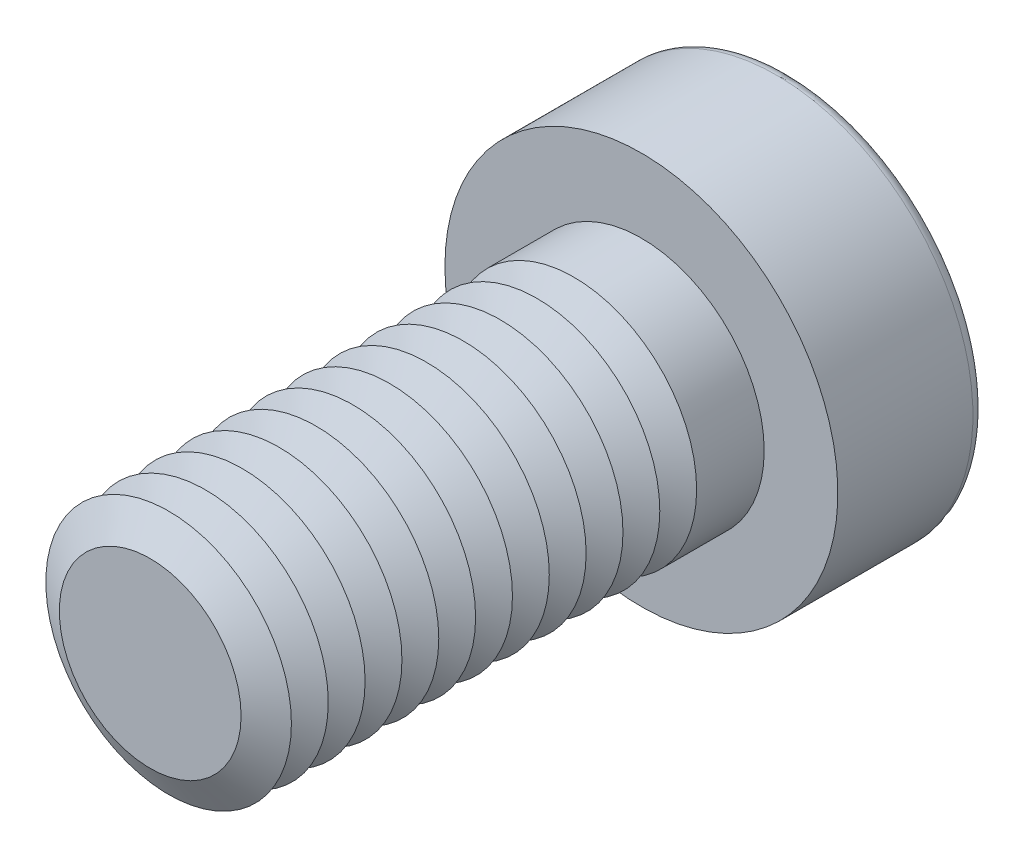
from build123d import *

# Parameters (mm, degrees)
SKETCH1_R           = 5
BOSS_EXTRUDE1_DEPTH = 20
SKETCH2_R           = 8
BOSS_EXTRUDE2_DEPTH = 6
CUT_EXTRUDE1_DEPTH  = 5.25
FILLET1_R           = 0.5
LPATTERN1_COUNT     = 12
LPATTERN1_PITCH     = 1.5


with BuildPart() as part:
    # Sketch1 → Boss-Extrude1 (new body)
    with BuildSketch(Plane.XY):
        Circle(SKETCH1_R)
    extrude(amount=BOSS_EXTRUDE1_DEPTH)

    # Sketch2 → Boss-Extrude2 (add)
    with BuildSketch(Plane(origin=(0, 0, 0), x_dir=(-1, 0, 0), z_dir=(0, 0, -1))):
        Circle(SKETCH2_R)
    extrude(amount=BOSS_EXTRUDE2_DEPTH)

    # Sketch3 → Cut-Extrude1 (cut)
    with BuildSketch(Plane(origin=(0, 0, -6), x_dir=(-1, 0, 0), z_dir=(0, 0, -1))):
        Polygon((-2.020725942, 3.5), (-4.041451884, 0), (-2.020725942, -3.5), (2.020725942, -3.5), (4.041451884, 0), (2.020725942, 3.5), align=None)
    extrude(amount=-CUT_EXTRUDE1_DEPTH, mode=Mode.SUBTRACT)

    # Fillet1
    fillet1_edges = [part.edges().sort_by_distance(p)[0] for p in [
        (8, 0, -6),
    ]]
    fillet(fillet1_edges, radius=FILLET1_R)

    # Cut-Extrude2 cone 1 section (on through the dimple's axis) → Cut-Extrude2 (revolve, cut)
    with BuildSketch(Plane(origin=(0, 0, -0.75), x_dir=(0, 1, 0), z_dir=(1, 0, 0))):
        Polygon((0, 0), (3.5, 0), (0, 2.020725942), align=None)
    revolve(axis=Axis((0, 0, -0.75), (0, 0, 1)), mode=Mode.SUBTRACT)

    # Cut-Extrude3 cone 1 section (on through the dimple's axis) → Cut-Extrude3 (revolve, cut)
    with BuildSketch(Plane(origin=(0, 0, -6), x_dir=(0, 1, 0), z_dir=(1, 0, 0))):
        Polygon((0, 0), (4.041451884, 0), (0, 1.082903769), align=None)
    revolve(axis=Axis((0, 0, -6), (0, 0, 1)), mode=Mode.SUBTRACT)

    # Sketch7 → Cut-Revolve1 (revolve, cut)
    with BuildSketch(Plane(origin=(0, 0, 0), x_dir=(0, 0, -1), z_dir=(1, 0, 0)), mode=Mode.PRIVATE) as cut_revolve1_sk:
        Polygon((-20, 3.700961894), (-19.25, 5), (-20.75, 5), align=None)
    cut_revolve1 = revolve(cut_revolve1_sk.sketch.rotate(Axis((0, 0, 20), (0, 0, -1)), 90), axis=Axis((0, 0, 20), (0, 0, -1)), mode=Mode.SUBTRACT)

    # LPattern1: Cut-Revolve1 ×12
    with Locations(*[(0, 0, -i * LPATTERN1_PITCH) for i in range(1, LPATTERN1_COUNT)]):
        add(cut_revolve1, mode=Mode.SUBTRACT)


solid = part.part
